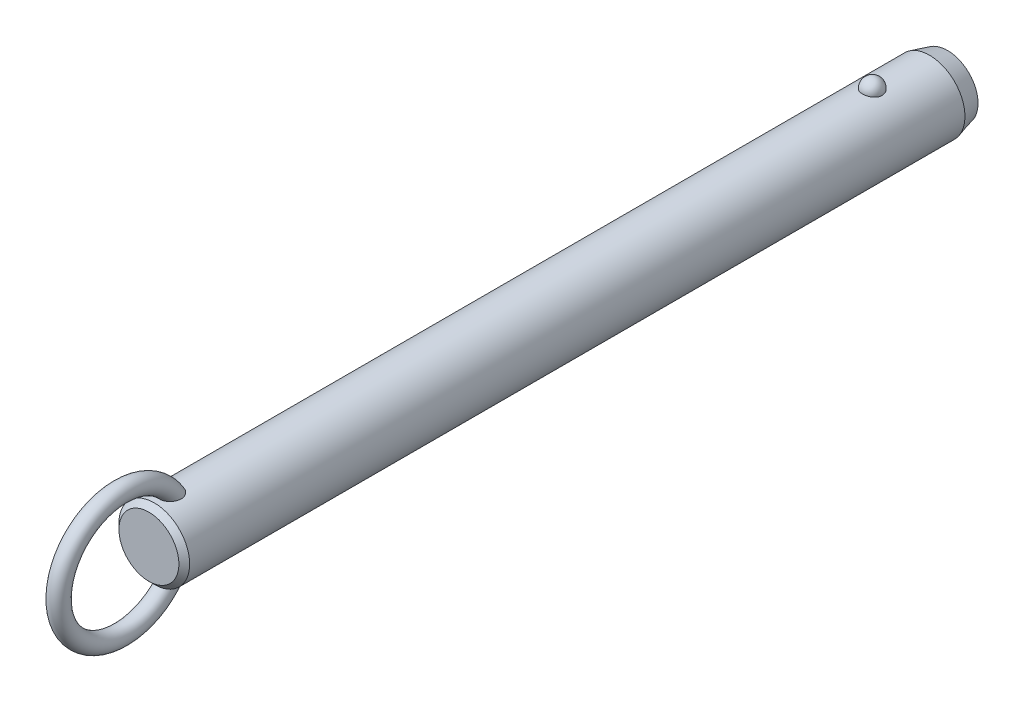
ISO-10303-21;
HEADER;
FILE_DESCRIPTION(('STEP AP214'),'2;1');
FILE_NAME('part.step','',(''),(''),'','','');
FILE_SCHEMA(('AUTOMOTIVE_DESIGN { 1 0 10303 214 1 1 1 1 }'));
ENDSEC;
DATA;
#1=APPLICATION_CONTEXT('core data for automotive mechanical design processes');
#2=APPLICATION_PROTOCOL_DEFINITION('international standard','automotive_design',2000,#1);
#3=PRODUCT_CONTEXT('',#1,'mechanical');
#4=PRODUCT('Part','Part','',(#3));
#5=PRODUCT_RELATED_PRODUCT_CATEGORY('part','',(#4));
#6=PRODUCT_DEFINITION_FORMATION('','',#4);
#7=PRODUCT_DEFINITION_CONTEXT('part definition',#1,'design');
#8=PRODUCT_DEFINITION('design','',#6,#7);
#9=PRODUCT_DEFINITION_SHAPE('','',#8);
#10=(LENGTH_UNIT() NAMED_UNIT(*) SI_UNIT(.MILLI.,.METRE.));
#11=(NAMED_UNIT(*) PLANE_ANGLE_UNIT() SI_UNIT($,.RADIAN.));
#12=(NAMED_UNIT(*) SI_UNIT($,.STERADIAN.) SOLID_ANGLE_UNIT());
#13=UNCERTAINTY_MEASURE_WITH_UNIT(LENGTH_MEASURE(1.E-05),#10,'distance_accuracy_value','');
#14=(GEOMETRIC_REPRESENTATION_CONTEXT(3) GLOBAL_UNCERTAINTY_ASSIGNED_CONTEXT((#13)) GLOBAL_UNIT_ASSIGNED_CONTEXT((#10,
#11,#12)) REPRESENTATION_CONTEXT('',''));
#15=CARTESIAN_POINT('',(0.,0.,0.));
#16=DIRECTION('',(0.,0.,1.));
#17=DIRECTION('',(1.,0.,0.));
#18=AXIS2_PLACEMENT_3D('',#15,#16,#17);
#19=CARTESIAN_POINT('',(0.,0.,149.9));
#20=DIRECTION('',(0.,0.,-1.));
#21=DIRECTION('',(-1.,0.,0.));
#22=AXIS2_PLACEMENT_3D('',#19,#20,#21);
#23=CYLINDRICAL_SURFACE('',#22,7.9);
#24=CARTESIAN_POINT('',(2.1785689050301,7.59367088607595,-2.19999999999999));
#25=CARTESIAN_POINT('',(2.17856679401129,7.59367269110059,-2.07701843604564));
#26=CARTESIAN_POINT('',(2.16853481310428,7.59657145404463,-1.95401006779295));
#27=CARTESIAN_POINT('',(2.12864689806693,7.607843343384,-1.71147811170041));
#28=CARTESIAN_POINT('',(2.09878338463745,7.61621856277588,-1.59195587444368));
#29=CARTESIAN_POINT('',(2.0199931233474,7.63749180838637,-1.3598563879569));
#30=CARTESIAN_POINT('',(1.97107475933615,7.6503878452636,-1.24727610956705));
#31=CARTESIAN_POINT('',(1.85539377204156,7.67926115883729,-1.03213234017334));
#32=CARTESIAN_POINT('',(1.78863158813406,7.69523835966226,-0.929568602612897));
#33=CARTESIAN_POINT('',(1.63856494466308,7.7285848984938,-0.736786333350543));
#34=CARTESIAN_POINT('',(1.55518140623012,7.7459606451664,-0.646630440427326));
#35=CARTESIAN_POINT('',(1.37422937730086,7.78009978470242,-0.481747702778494));
#36=CARTESIAN_POINT('',(1.27666086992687,7.79686317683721,-0.407020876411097));
#37=CARTESIAN_POINT('',(1.07024728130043,7.82786153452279,-0.275278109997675));
#38=CARTESIAN_POINT('',(0.961434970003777,7.84210353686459,-0.218212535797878));
#39=CARTESIAN_POINT('',(0.735351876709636,7.86652194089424,-0.123146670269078));
#40=CARTESIAN_POINT('',(0.618082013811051,7.87669878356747,-0.085144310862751));
#41=CARTESIAN_POINT('',(0.380637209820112,7.89170521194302,-0.0298158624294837));
#42=CARTESIAN_POINT('',(0.260550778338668,7.89662650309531,-0.0121347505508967));
#43=CARTESIAN_POINT('',(0.0190117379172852,7.90090003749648,0.00324379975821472));
#44=CARTESIAN_POINT('',(-0.102440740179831,7.90025280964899,0.00094313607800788));
#45=CARTESIAN_POINT('',(-0.341452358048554,7.89351056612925,-0.0233955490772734));
#46=CARTESIAN_POINT('',(-0.459042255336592,7.88749257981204,-0.0451545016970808));
#47=CARTESIAN_POINT('',(-0.688796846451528,7.87075812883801,-0.107408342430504));
#48=CARTESIAN_POINT('',(-0.800961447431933,7.86004158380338,-0.147903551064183));
#49=CARTESIAN_POINT('',(-1.01743634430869,7.83497131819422,-0.246799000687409));
#50=CARTESIAN_POINT('',(-1.12169791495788,7.82059709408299,-0.305300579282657));
#51=CARTESIAN_POINT('',(-1.31891765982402,7.78976470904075,-0.438549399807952));
#52=CARTESIAN_POINT('',(-1.41187469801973,7.77330633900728,-0.513298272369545));
#53=CARTESIAN_POINT('',(-1.58577142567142,7.73972434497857,-0.678622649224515));
#54=CARTESIAN_POINT('',(-1.66645140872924,7.72259402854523,-0.769470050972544));
#55=CARTESIAN_POINT('',(-1.81161503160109,7.68983776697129,-0.963538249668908));
#56=CARTESIAN_POINT('',(-1.87609753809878,7.6742119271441,-1.06675991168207));
#57=CARTESIAN_POINT('',(-1.98790138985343,7.6460202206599,-1.28401170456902));
#58=CARTESIAN_POINT('',(-2.03501994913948,7.63349104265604,-1.39815107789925));
#59=CARTESIAN_POINT('',(-2.10986724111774,7.6131449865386,-1.63301784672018));
#60=CARTESIAN_POINT('',(-2.1375965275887,7.60532797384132,-1.75374505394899));
#61=CARTESIAN_POINT('',(-2.17289256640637,7.5953195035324,-1.99782562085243));
#62=CARTESIAN_POINT('',(-2.18054294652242,7.59310471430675,-2.12116592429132));
#63=CARTESIAN_POINT('',(-2.17572919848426,7.59448538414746,-2.36741799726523));
#64=CARTESIAN_POINT('',(-2.1632656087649,7.59808068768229,-2.49032977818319));
#65=CARTESIAN_POINT('',(-2.11865035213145,7.61064035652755,-2.73161015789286));
#66=CARTESIAN_POINT('',(-2.08659579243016,7.61957823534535,-2.84999812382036));
#67=CARTESIAN_POINT('',(-2.00367799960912,7.64179982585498,-3.07955956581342));
#68=CARTESIAN_POINT('',(-1.9528140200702,7.65508371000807,-3.19073275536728));
#69=CARTESIAN_POINT('',(-1.83321113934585,7.68460381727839,-3.40337899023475));
#70=CARTESIAN_POINT('',(-1.76437735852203,7.70085556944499,-3.50479651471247));
#71=CARTESIAN_POINT('',(-1.61069526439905,7.73445734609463,-3.69446912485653));
#72=CARTESIAN_POINT('',(-1.52584634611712,7.75180741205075,-3.78272371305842));
#73=CARTESIAN_POINT('',(-1.34198059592,7.78574608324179,-3.94393987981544));
#74=CARTESIAN_POINT('',(-1.24291308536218,7.80233167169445,-4.01684434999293));
#75=CARTESIAN_POINT('',(-1.03352039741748,7.83281625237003,-4.14489386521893));
#76=CARTESIAN_POINT('',(-0.92319600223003,7.84671543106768,-4.20004014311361));
#77=CARTESIAN_POINT('',(-0.695822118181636,7.87011575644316,-4.29042017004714));
#78=CARTESIAN_POINT('',(-0.578872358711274,7.87966903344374,-4.32589112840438));
#79=CARTESIAN_POINT('',(-0.340410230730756,7.8935652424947,-4.37692226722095));
#80=CARTESIAN_POINT('',(-0.218898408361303,7.89790879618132,-4.39248482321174));
#81=CARTESIAN_POINT('',(0.0228107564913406,7.90087453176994,-4.40314405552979));
#82=CARTESIAN_POINT('',(0.142990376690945,7.89960185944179,-4.39861683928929));
#83=CARTESIAN_POINT('',(0.380829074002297,7.89171262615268,-4.37008293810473));
#84=CARTESIAN_POINT('',(0.498488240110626,7.8850962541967,-4.34607694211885));
#85=CARTESIAN_POINT('',(0.727535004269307,7.86726442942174,-4.27939317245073));
#86=CARTESIAN_POINT('',(0.838944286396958,7.85606616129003,-4.236785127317));
#87=CARTESIAN_POINT('',(1.05295421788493,7.83025654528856,-4.13408348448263));
#88=CARTESIAN_POINT('',(1.15555431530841,7.81564498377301,-4.07398879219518));
#89=CARTESIAN_POINT('',(1.35076763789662,7.7843022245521,-3.93687432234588));
#90=CARTESIAN_POINT('',(1.4432046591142,7.76754209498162,-3.85961036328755));
#91=CARTESIAN_POINT('',(1.6139111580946,7.73387857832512,-3.69076949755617));
#92=CARTESIAN_POINT('',(1.6921781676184,7.71697516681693,-3.59919010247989));
#93=CARTESIAN_POINT('',(1.83380875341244,7.6845643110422,-3.40247278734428));
#94=CARTESIAN_POINT('',(1.89689280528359,7.66908588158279,-3.29712873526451));
#95=CARTESIAN_POINT('',(2.0047823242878,7.64159441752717,-3.07707931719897));
#96=CARTESIAN_POINT('',(2.0495945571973,7.62958010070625,-2.96237743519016));
#97=CARTESIAN_POINT('',(2.11580183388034,7.61146617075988,-2.74040519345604));
#98=CARTESIAN_POINT('',(2.13929812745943,7.60484503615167,-2.63379846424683));
#99=CARTESIAN_POINT('',(2.17068242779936,7.59594664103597,-2.41813481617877));
#100=CARTESIAN_POINT('',(2.17857077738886,7.59366928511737,-2.30907795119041));
#101=CARTESIAN_POINT('',(2.1785689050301,7.59367088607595,-2.19999999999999));
#102=B_SPLINE_CURVE_WITH_KNOTS('',3,(#24,#25,#26,#27,#28,#29,#30,#31,#32,#33,#34,#35,#36,#37,
#38,#39,#40,#41,#42,#43,#44,#45,#46,#47,#48,#49,#50,#51,#52,#53,#54,#55,#56,#57,#58,#59,#60,#61,
#62,#63,#64,#65,#66,#67,#68,#69,#70,#71,#72,#73,#74,#75,#76,#77,#78,#79,#80,#81,#82,#83,#84,#85,
#86,#87,#88,#89,#90,#91,#92,#93,#94,#95,#96,#97,#98,#99,#100,#101),.UNSPECIFIED.,.T.,.F.,(4,2,2,
2,2,2,2,2,2,2,2,2,2,2,2,2,2,2,2,2,2,2,2,2,2,2,2,2,2,2,2,2,2,2,2,2,2,2,4),(0.,0.368552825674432,
0.737246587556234,1.10577831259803,1.4743009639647,1.8446206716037,2.21494081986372,
2.5842105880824,2.95344028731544,3.31611630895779,3.67875788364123,4.03628044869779,
4.39380913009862,4.75338791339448,5.11300280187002,5.47939989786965,5.8458226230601,
6.21639834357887,6.58696347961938,6.95598276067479,7.32499216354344,7.69218715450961,
8.0593967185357,8.42858578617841,8.79778880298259,9.16834203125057,9.5388695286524,
9.90482699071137,10.2707407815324,10.6298333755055,10.9889132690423,11.3466585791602,
11.7044262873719,12.0676511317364,12.4309391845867,12.8004764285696,13.1698767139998,
13.4967701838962,13.8236564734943),.UNSPECIFIED.);
#103=CARTESIAN_POINT('',(2.1785689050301,7.59367088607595,-2.19999999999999));
#104=VERTEX_POINT('',#103);
#105=EDGE_CURVE('E41',#104,#104,#102,.T.);
#106=ORIENTED_EDGE('',*,*,#105,.T.);
#107=EDGE_LOOP('',(#106));
#108=FACE_BOUND('',#107,.T.);
#109=CARTESIAN_POINT('',(0.,0.,158.22));
#110=DIRECTION('',(0.,0.,1.));
#111=DIRECTION('',(1.,0.,0.));
#112=AXIS2_PLACEMENT_3D('',#109,#110,#111);
#113=CIRCLE('',#112,7.9);
#114=CARTESIAN_POINT('',(7.9,0.,158.22));
#115=VERTEX_POINT('',#114);
#116=EDGE_CURVE('E10',#115,#115,#113,.F.);
#117=ORIENTED_EDGE('',*,*,#116,.T.);
#118=EDGE_LOOP('',(#117));
#119=FACE_BOUND('',#118,.T.);
#120=CARTESIAN_POINT('',(-0.630969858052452,-7.87476203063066,152.112432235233));
#121=CARTESIAN_POINT('',(-0.734180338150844,-7.86648998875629,152.147285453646));
#122=CARTESIAN_POINT('',(-0.834476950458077,-7.85639291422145,152.190816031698));
#123=CARTESIAN_POINT('',(-1.0262035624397,-7.83366343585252,152.294094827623));
#124=CARTESIAN_POINT('',(-1.1176141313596,-7.82102565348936,152.353877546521));
#125=CARTESIAN_POINT('',(-1.28877277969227,-7.79464922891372,152.487839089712));
#126=CARTESIAN_POINT('',(-1.36854014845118,-7.78091246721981,152.561993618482));
#127=CARTESIAN_POINT('',(-1.51461521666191,-7.75380398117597,152.722494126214));
#128=CARTESIAN_POINT('',(-1.58092966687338,-7.74043207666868,152.808833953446));
#129=CARTESIAN_POINT('',(-1.70019064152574,-7.7151252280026,152.992978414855));
#130=CARTESIAN_POINT('',(-1.75284037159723,-7.70322473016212,153.090979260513));
#131=CARTESIAN_POINT('',(-1.84263464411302,-7.68224112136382,153.294102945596));
#132=CARTESIAN_POINT('',(-1.87977299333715,-7.6731591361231,153.399228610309));
#133=CARTESIAN_POINT('',(-1.94152728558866,-7.65777930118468,153.623284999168));
#134=CARTESIAN_POINT('',(-1.96475471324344,-7.65179654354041,153.742616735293));
#135=CARTESIAN_POINT('',(-1.99449499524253,-7.64409642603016,153.98342986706));
#136=CARTESIAN_POINT('',(-2.0010005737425,-7.64238092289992,154.104912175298));
#137=CARTESIAN_POINT('',(-1.99856014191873,-7.64302120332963,154.368340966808));
#138=CARTESIAN_POINT('',(-1.98680021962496,-7.64611845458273,154.51025654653));
#139=CARTESIAN_POINT('',(-1.94457772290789,-7.65696186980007,154.791118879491));
#140=CARTESIAN_POINT('',(-1.91409393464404,-7.66471330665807,154.930062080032));
#141=CARTESIAN_POINT('',(-1.82768670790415,-7.68582947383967,155.231939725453));
#142=CARTESIAN_POINT('',(-1.76772963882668,-7.70003779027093,155.393686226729));
#143=CARTESIAN_POINT('',(-1.65998501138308,-7.72371550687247,155.627695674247));
#144=CARTESIAN_POINT('',(-1.62107967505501,-7.73200670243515,155.704297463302));
#145=CARTESIAN_POINT('',(-1.53727726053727,-7.74910377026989,155.854079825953));
#146=CARTESIAN_POINT('',(-1.49238215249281,-7.75790947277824,155.927261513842));
#147=CARTESIAN_POINT('',(-1.37397050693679,-7.77993338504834,156.10288382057));
#148=CARTESIAN_POINT('',(-1.29690364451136,-7.79328473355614,156.202955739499));
#149=CARTESIAN_POINT('',(-1.1288548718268,-7.81939266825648,156.390714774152));
#150=CARTESIAN_POINT('',(-1.0378992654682,-7.83215032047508,156.478424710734));
#151=CARTESIAN_POINT('',(-0.86953281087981,-7.85231710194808,156.613414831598));
#152=CARTESIAN_POINT('',(-0.795716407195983,-7.86021093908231,156.665076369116));
#153=CARTESIAN_POINT('',(-0.640813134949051,-7.87434920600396,156.756381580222));
#154=CARTESIAN_POINT('',(-0.559737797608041,-7.88059619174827,156.79604389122));
#155=CARTESIAN_POINT('',(-0.406456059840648,-7.88984116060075,156.854300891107));
#156=CARTESIAN_POINT('',(-0.335227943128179,-7.89321892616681,156.875384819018));
#157=CARTESIAN_POINT('',(-0.190193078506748,-7.89804235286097,156.90541418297));
#158=CARTESIAN_POINT('',(-0.11638863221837,-7.89948969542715,156.914370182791));
#159=CARTESIAN_POINT('',(0.0318414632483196,-7.90028409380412,156.919291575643));
#160=CARTESIAN_POINT('',(0.106268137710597,-7.89962640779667,156.915227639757));
#161=CARTESIAN_POINT('',(0.253290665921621,-7.8962818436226,156.894461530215));
#162=CARTESIAN_POINT('',(0.325885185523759,-7.8935935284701,156.877750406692));
#163=CARTESIAN_POINT('',(0.481441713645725,-7.88577340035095,156.828738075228));
#164=CARTESIAN_POINT('',(0.563611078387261,-7.88026321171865,156.794005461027));
#165=CARTESIAN_POINT('',(0.721129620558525,-7.86741729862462,156.711796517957));
#166=CARTESIAN_POINT('',(0.796466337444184,-7.86007832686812,156.664297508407));
#167=CARTESIAN_POINT('',(0.971456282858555,-7.84073285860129,156.536513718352));
#168=CARTESIAN_POINT('',(1.06719686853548,-7.82809461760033,156.451004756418));
#169=CARTESIAN_POINT('',(1.24418921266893,-7.80192439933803,156.266232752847));
#170=CARTESIAN_POINT('',(1.32540832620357,-7.78839049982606,156.166939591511));
#171=CARTESIAN_POINT('',(1.45199971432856,-7.76559693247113,155.989576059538));
#172=CARTESIAN_POINT('',(1.50085649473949,-7.75626094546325,155.913954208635));
#173=CARTESIAN_POINT('',(1.59197749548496,-7.7380727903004,155.758742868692));
#174=CARTESIAN_POINT('',(1.63423919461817,-7.72922080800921,155.679151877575));
#175=CARTESIAN_POINT('',(1.71222612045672,-7.71231959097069,155.516664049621));
#176=CARTESIAN_POINT('',(1.74794516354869,-7.70427111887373,155.433764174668));
#177=CARTESIAN_POINT('',(1.81270113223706,-7.68929240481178,155.265296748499));
#178=CARTESIAN_POINT('',(1.84173789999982,-7.68236218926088,155.179729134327));
#179=CARTESIAN_POINT('',(1.89322698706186,-7.6698375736,155.00528702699));
#180=CARTESIAN_POINT('',(1.91558744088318,-7.66426199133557,154.916383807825));
#181=CARTESIAN_POINT('',(1.95281367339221,-7.65485915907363,154.736969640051));
#182=CARTESIAN_POINT('',(1.96767946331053,-7.65103190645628,154.646458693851));
#183=CARTESIAN_POINT('',(2.00021456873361,-7.64262981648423,154.373732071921));
#184=CARTESIAN_POINT('',(2.00600691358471,-7.6410871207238,154.189709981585));
#185=CARTESIAN_POINT('',(1.98445334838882,-7.64669564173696,153.876501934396));
#186=CARTESIAN_POINT('',(1.96607186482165,-7.65149688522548,153.746618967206));
#187=CARTESIAN_POINT('',(1.90884967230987,-7.6659762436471,153.491632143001));
#188=CARTESIAN_POINT('',(1.87002101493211,-7.67565148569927,153.366525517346));
#189=CARTESIAN_POINT('',(1.77063986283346,-7.69918471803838,153.12454013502));
#190=CARTESIAN_POINT('',(1.70993724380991,-7.71307150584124,153.007725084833));
#191=CARTESIAN_POINT('',(1.56733070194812,-7.74330306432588,152.788144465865));
#192=CARTESIAN_POINT('',(1.48543692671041,-7.75964665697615,152.685372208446));
#193=CARTESIAN_POINT('',(1.31346177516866,-7.79047523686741,152.509380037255));
#194=CARTESIAN_POINT('',(1.22547278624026,-7.80495298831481,152.434106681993));
#195=CARTESIAN_POINT('',(1.0372435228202,-7.83218597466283,152.300486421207));
#196=CARTESIAN_POINT('',(0.937008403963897,-7.84494192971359,152.242132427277));
#197=CARTESIAN_POINT('',(0.73359933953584,-7.86649045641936,152.147027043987));
#198=CARTESIAN_POINT('',(0.630941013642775,-7.87547134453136,152.109210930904));
#199=CARTESIAN_POINT('',(0.420465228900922,-7.88950708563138,152.051116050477));
#200=CARTESIAN_POINT('',(0.312645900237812,-7.89456050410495,152.03084369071));
#201=CARTESIAN_POINT('',(0.0960869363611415,-7.9001518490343,152.008455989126));
#202=CARTESIAN_POINT('',(-0.012634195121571,-7.90073226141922,152.006169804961));
#203=CARTESIAN_POINT('',(-0.228766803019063,-7.89742350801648,152.019367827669));
#204=CARTESIAN_POINT('',(-0.336180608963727,-7.89354403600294,152.034813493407));
#205=CARTESIAN_POINT('',(-0.473410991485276,-7.88586871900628,152.066217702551));
#206=CARTESIAN_POINT('',(-0.505257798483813,-7.88388984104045,152.074354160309));
#207=CARTESIAN_POINT('',(-0.568481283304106,-7.87958326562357,152.092208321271));
#208=CARTESIAN_POINT('',(-0.599857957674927,-7.87725556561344,152.101926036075));
#209=CARTESIAN_POINT('',(-0.630969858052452,-7.87476203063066,152.112432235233));
#210=B_SPLINE_CURVE_WITH_KNOTS('',3,(#120,#121,#122,#123,#124,#125,#126,#127,#128,#129,#130,
#131,#132,#133,#134,#135,#136,#137,#138,#139,#140,#141,#142,#143,#144,#145,#146,#147,#148,#149,
#150,#151,#152,#153,#154,#155,#156,#157,#158,#159,#160,#161,#162,#163,#164,#165,#166,#167,#168,
#169,#170,#171,#172,#173,#174,#175,#176,#177,#178,#179,#180,#181,#182,#183,#184,#185,#186,#187,
#188,#189,#190,#191,#192,#193,#194,#195,#196,#197,#198,#199,#200,#201,#202,#203,#204,#205,#206,
#207,#208,#209),.UNSPECIFIED.,.T.,.F.,(4,2,2,2,2,2,2,2,2,2,2,2,2,2,2,2,2,2,2,2,2,2,2,2,2,2,2,2,
2,2,2,2,2,2,2,2,2,2,2,2,2,2,2,2,4),(0.,0.327622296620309,0.655945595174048,0.983718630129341,
1.3113267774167,1.64554655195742,1.97989964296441,2.34365728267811,2.70757317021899,
3.13333684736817,3.55958380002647,4.07655306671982,4.33527897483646,4.59391999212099,
4.97382437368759,5.353017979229,5.62348245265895,5.89352465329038,6.11565959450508,
6.33760092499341,6.56004255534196,6.78264174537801,7.0493084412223,7.31645206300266,
7.70130871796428,8.08701995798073,8.35824509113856,8.62957365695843,8.9011573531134,
9.1727474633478,9.44791855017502,9.72308922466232,10.2715298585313,10.6638393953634,
11.0559179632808,11.4507403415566,11.8453740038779,12.1936425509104,12.5417649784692,
12.8695063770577,13.1973674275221,13.5221104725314,13.8461490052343,13.9449071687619,
14.0436660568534),.UNSPECIFIED.);
#211=CARTESIAN_POINT('',(-0.630969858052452,-7.87476203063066,152.112432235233));
#212=VERTEX_POINT('',#211);
#213=EDGE_CURVE('E59',#212,#212,#210,.T.);
#214=ORIENTED_EDGE('',*,*,#213,.T.);
#215=EDGE_LOOP('',(#214));
#216=FACE_BOUND('',#215,.T.);
#217=CARTESIAN_POINT('',(-0.630969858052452,7.87476203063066,152.112432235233));
#218=CARTESIAN_POINT('',(-0.528918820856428,7.88293636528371,152.077979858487));
#219=CARTESIAN_POINT('',(-0.423745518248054,7.88934810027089,152.051915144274));
#220=CARTESIAN_POINT('',(-0.210236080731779,7.8979273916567,152.017282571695));
#221=CARTESIAN_POINT('',(-0.101893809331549,7.90008607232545,152.008751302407));
#222=CARTESIAN_POINT('',(0.11466056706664,7.89990877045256,152.009457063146));
#223=CARTESIAN_POINT('',(0.222872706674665,7.89757640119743,152.01867980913));
#224=CARTESIAN_POINT('',(0.436107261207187,7.88867538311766,152.054652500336));
#225=CARTESIAN_POINT('',(0.541131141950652,7.8821087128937,152.08139425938));
#226=CARTESIAN_POINT('',(0.745085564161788,7.86545130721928,152.151756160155));
#227=CARTESIAN_POINT('',(0.844015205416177,7.85536005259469,152.195378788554));
#228=CARTESIAN_POINT('',(1.03299167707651,7.83275153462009,152.298379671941));
#229=CARTESIAN_POINT('',(1.12303841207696,7.8202342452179,152.357758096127));
#230=CARTESIAN_POINT('',(1.29214734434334,7.79408219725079,152.490864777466));
#231=CARTESIAN_POINT('',(1.37116907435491,7.78044359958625,152.564643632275));
#232=CARTESIAN_POINT('',(1.51597677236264,7.75353170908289,152.724235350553));
#233=CARTESIAN_POINT('',(1.58176261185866,7.74025841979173,152.810048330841));
#234=CARTESIAN_POINT('',(1.70057386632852,7.71504069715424,152.993644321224));
#235=CARTESIAN_POINT('',(1.75320073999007,7.7031425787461,153.091690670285));
#236=CARTESIAN_POINT('',(1.8429376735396,7.68216822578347,153.294893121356));
#237=CARTESIAN_POINT('',(1.88004278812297,7.67309289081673,153.400051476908));
#238=CARTESIAN_POINT('',(1.9417232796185,7.6577294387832,153.624167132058));
#239=CARTESIAN_POINT('',(1.96491037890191,7.65175648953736,153.743524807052));
#240=CARTESIAN_POINT('',(1.9945689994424,7.64407702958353,153.984384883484));
#241=CARTESIAN_POINT('',(2.00103304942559,7.64237242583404,154.10588821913));
#242=CARTESIAN_POINT('',(1.99850166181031,7.64303650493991,154.369368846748));
#243=CARTESIAN_POINT('',(1.98669038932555,7.64614714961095,154.511314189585));
#244=CARTESIAN_POINT('',(1.94436120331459,7.6570170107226,154.792228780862));
#245=CARTESIAN_POINT('',(1.91382203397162,7.66478150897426,154.931194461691));
#246=CARTESIAN_POINT('',(1.82728754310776,7.68592483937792,155.233111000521));
#247=CARTESIAN_POINT('',(1.76725778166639,7.7001468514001,155.394872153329));
#248=CARTESIAN_POINT('',(1.65939700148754,7.72384204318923,155.628891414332));
#249=CARTESIAN_POINT('',(1.62045187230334,7.73213852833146,155.705494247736));
#250=CARTESIAN_POINT('',(1.53656684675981,7.74924489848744,155.855273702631));
#251=CARTESIAN_POINT('',(1.49162892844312,7.75805461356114,155.928451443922));
#252=CARTESIAN_POINT('',(1.37317698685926,7.78007342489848,156.103952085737));
#253=CARTESIAN_POINT('',(1.29612360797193,7.79341423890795,156.203911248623));
#254=CARTESIAN_POINT('',(1.12812043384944,7.81949839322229,156.39145083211));
#255=CARTESIAN_POINT('',(1.03719688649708,7.83224280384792,156.479054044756));
#256=CARTESIAN_POINT('',(0.868871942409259,7.85239026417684,156.61389715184));
#257=CARTESIAN_POINT('',(0.795056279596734,7.86027769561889,156.665511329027));
#258=CARTESIAN_POINT('',(0.640160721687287,7.87440222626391,156.756720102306));
#259=CARTESIAN_POINT('',(0.559092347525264,7.88064188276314,156.796333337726));
#260=CARTESIAN_POINT('',(0.405820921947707,7.8898738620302,156.854505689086));
#261=CARTESIAN_POINT('',(0.334594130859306,7.89324577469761,156.875552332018));
#262=CARTESIAN_POINT('',(0.189568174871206,7.89805733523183,156.905507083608));
#263=CARTESIAN_POINT('',(0.115771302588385,7.89949866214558,156.914425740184));
#264=CARTESIAN_POINT('',(-0.0324359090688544,7.90028156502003,156.91927589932));
#265=CARTESIAN_POINT('',(-0.106847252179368,7.89961843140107,156.915178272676));
#266=CARTESIAN_POINT('',(-0.253834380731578,7.8962642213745,156.894351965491));
#267=CARTESIAN_POINT('',(-0.326408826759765,7.89357170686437,156.877614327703));
#268=CARTESIAN_POINT('',(-0.481962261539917,7.88574179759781,156.828539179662));
#269=CARTESIAN_POINT('',(-0.564145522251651,7.88022507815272,156.793763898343));
#270=CARTESIAN_POINT('',(-0.7216852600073,7.86736646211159,156.711468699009));
#271=CARTESIAN_POINT('',(-0.797029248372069,7.8600213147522,156.663926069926));
#272=CARTESIAN_POINT('',(-0.972044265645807,7.84066026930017,156.536026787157));
#273=CARTESIAN_POINT('',(-1.06779803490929,7.828012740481,156.450443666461));
#274=CARTESIAN_POINT('',(-1.24480531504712,7.80182621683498,156.265522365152));
#275=CARTESIAN_POINT('',(-1.32602618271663,7.78828530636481,156.166154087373));
#276=CARTESIAN_POINT('',(-1.45259834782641,7.76548487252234,155.988680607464));
#277=CARTESIAN_POINT('',(-1.5014385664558,7.75614818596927,155.913025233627));
#278=CARTESIAN_POINT('',(-1.59252410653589,7.73796020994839,155.757748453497));
#279=CARTESIAN_POINT('',(-1.63476690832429,7.729109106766,155.678125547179));
#280=CARTESIAN_POINT('',(-1.7127131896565,7.71221133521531,155.515575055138));
#281=CARTESIAN_POINT('',(-1.74841047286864,7.70416543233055,155.432644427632));
#282=CARTESIAN_POINT('',(-1.81311929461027,7.6891937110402,155.264116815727));
#283=CARTESIAN_POINT('',(-1.84213067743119,7.68226791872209,155.178519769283));
#284=CARTESIAN_POINT('',(-1.89356259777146,7.66975461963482,155.004025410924));
#285=CARTESIAN_POINT('',(-1.91589165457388,7.66418586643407,154.915099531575));
#286=CARTESIAN_POINT('',(-1.9530507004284,7.65479859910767,154.735642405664));
#287=CARTESIAN_POINT('',(-1.96788069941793,7.65098008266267,154.645111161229));
#288=CARTESIAN_POINT('',(-2.00030078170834,7.64260704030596,154.372327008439));
#289=CARTESIAN_POINT('',(-2.00600576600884,7.64108760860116,154.188271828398));
#290=CARTESIAN_POINT('',(-1.9842848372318,7.64673945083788,153.875080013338));
#291=CARTESIAN_POINT('',(-1.96583698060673,7.65155751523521,153.745240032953));
#292=CARTESIAN_POINT('',(-1.90848948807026,7.66606613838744,153.490361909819));
#293=CARTESIAN_POINT('',(-1.86960376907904,7.67575338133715,153.365320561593));
#294=CARTESIAN_POINT('',(-1.77013421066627,7.6993013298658,153.123500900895));
#295=CARTESIAN_POINT('',(-1.70940488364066,7.71318991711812,153.006784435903));
#296=CARTESIAN_POINT('',(-1.5667295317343,7.74342495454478,152.787340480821));
#297=CARTESIAN_POINT('',(-1.48478316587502,7.75977144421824,152.68461321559));
#298=CARTESIAN_POINT('',(-1.31266325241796,7.79061163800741,152.508643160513));
#299=CARTESIAN_POINT('',(-1.22456383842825,7.80509908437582,152.433358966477));
#300=CARTESIAN_POINT('',(-1.03622400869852,7.83231881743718,152.299865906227));
#301=CARTESIAN_POINT('',(-0.93601531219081,7.84505551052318,152.241613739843));
#302=CARTESIAN_POINT('',(-0.798824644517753,7.85957802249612,152.177540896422));
#303=CARTESIAN_POINT('',(-0.765787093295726,7.86286821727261,152.163224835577));
#304=CARTESIAN_POINT('',(-0.698939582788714,7.86909211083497,152.136436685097));
#305=CARTESIAN_POINT('',(-0.665129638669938,7.8720258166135,152.123964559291));
#306=CARTESIAN_POINT('',(-0.630969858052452,7.87476203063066,152.112432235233));
#307=B_SPLINE_CURVE_WITH_KNOTS('',3,(#217,#218,#219,#220,#221,#222,#223,#224,#225,#226,#227,
#228,#229,#230,#231,#232,#233,#234,#235,#236,#237,#238,#239,#240,#241,#242,#243,#244,#245,#246,
#247,#248,#249,#250,#251,#252,#253,#254,#255,#256,#257,#258,#259,#260,#261,#262,#263,#264,#265,
#266,#267,#268,#269,#270,#271,#272,#273,#274,#275,#276,#277,#278,#279,#280,#281,#282,#283,#284,
#285,#286,#287,#288,#289,#290,#291,#292,#293,#294,#295,#296,#297,#298,#299,#300,#301,#302,#303,
#304,#305,#306),.UNSPECIFIED.,.T.,.F.,(4,2,2,2,2,2,2,2,2,2,2,2,2,2,2,2,2,2,2,2,2,2,2,2,2,2,2,2,
2,2,2,2,2,2,2,2,2,2,2,2,2,2,2,2,4),(0.,0.323920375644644,0.648516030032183,0.972850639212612,
1.29703380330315,1.62126473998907,1.94549915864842,2.27089401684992,2.59629203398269,
2.93059633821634,3.26500707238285,3.6288164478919,3.99278833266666,4.41865421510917,
4.84500434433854,5.36209210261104,5.62087589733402,5.87957448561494,6.25918598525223,
6.63808782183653,6.90846748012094,7.17842501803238,7.40052350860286,7.62242871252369,
7.84483086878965,8.0673907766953,8.33414615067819,8.60137921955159,8.98641454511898,
9.37230415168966,9.64358673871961,9.91497268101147,10.1866142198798,10.4582620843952,
10.7334745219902,11.008686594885,11.5572126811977,11.9494246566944,12.3413699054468,
12.7359755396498,13.1305875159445,13.4791770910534,13.82687259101,13.9353013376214,
14.0437279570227),.UNSPECIFIED.);
#308=CARTESIAN_POINT('',(-0.630969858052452,7.87476203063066,152.112432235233));
#309=VERTEX_POINT('',#308);
#310=EDGE_CURVE('E67',#309,#309,#307,.T.);
#311=ORIENTED_EDGE('',*,*,#310,.T.);
#312=EDGE_LOOP('',(#311));
#313=FACE_BOUND('',#312,.T.);
#314=CARTESIAN_POINT('',(0.,0.,-14.9999999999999));
#315=DIRECTION('',(0.,0.,-1.));
#316=DIRECTION('',(-1.,0.,0.));
#317=AXIS2_PLACEMENT_3D('',#314,#315,#316);
#318=CIRCLE('',#317,7.9);
#319=CARTESIAN_POINT('',(-7.9,0.,-14.9999999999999));
#320=VERTEX_POINT('',#319);
#321=EDGE_CURVE('E56',#320,#320,#318,.F.);
#322=ORIENTED_EDGE('',*,*,#321,.T.);
#323=EDGE_LOOP('',(#322));
#324=FACE_BOUND('',#323,.T.);
#325=ADVANCED_FACE('F37',(#108,#119,#216,#313,#324),#23,.T.);
#326=CARTESIAN_POINT('',(0.,0.,-19.));
#327=DIRECTION('',(0.,0.,-1.));
#328=DIRECTION('',(-1.,0.,0.));
#329=AXIS2_PLACEMENT_3D('',#326,#327,#328);
#330=PLANE('',#329);
#331=CARTESIAN_POINT('',(0.,0.,-19.));
#332=DIRECTION('',(0.,0.,-1.));
#333=DIRECTION('',(-1.,0.,0.));
#334=AXIS2_PLACEMENT_3D('',#331,#332,#333);
#335=CIRCLE('',#334,6.82820323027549);
#336=CARTESIAN_POINT('',(-6.82820323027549,0.,-19.));
#337=VERTEX_POINT('',#336);
#338=EDGE_CURVE('E66',#337,#337,#335,.T.);
#339=ORIENTED_EDGE('',*,*,#338,.T.);
#340=EDGE_LOOP('',(#339));
#341=FACE_BOUND('',#340,.T.);
#342=ADVANCED_FACE('F85',(#341),#330,.T.);
#343=CARTESIAN_POINT('',(0.,0.,-19.));
#344=DIRECTION('',(0.,0.,1.));
#345=DIRECTION('',(1.,0.,0.));
#346=AXIS2_PLACEMENT_3D('',#343,#344,#345);
#347=CONICAL_SURFACE('',#346,6.82820323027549,0.261799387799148);
#348=ORIENTED_EDGE('',*,*,#321,.F.);
#349=EDGE_LOOP('',(#348));
#350=FACE_BOUND('',#349,.T.);
#351=ORIENTED_EDGE('',*,*,#338,.F.);
#352=EDGE_LOOP('',(#351));
#353=FACE_BOUND('',#352,.T.);
#354=ADVANCED_FACE('F83',(#350,#353),#347,.T.);
#355=CARTESIAN_POINT('',(0.,0.,159.42));
#356=DIRECTION('',(0.,0.,1.));
#357=DIRECTION('',(1.,0.,0.));
#358=AXIS2_PLACEMENT_3D('',#355,#356,#357);
#359=PLANE('',#358);
#360=CARTESIAN_POINT('',(0.,0.,159.42));
#361=DIRECTION('',(0.,0.,1.));
#362=DIRECTION('',(1.,0.,0.));
#363=AXIS2_PLACEMENT_3D('',#360,#361,#362);
#364=CIRCLE('',#363,6.70000000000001);
#365=CARTESIAN_POINT('',(6.70000000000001,0.,159.42));
#366=VERTEX_POINT('',#365);
#367=EDGE_CURVE('E50',#366,#366,#364,.T.);
#368=ORIENTED_EDGE('',*,*,#367,.T.);
#369=EDGE_LOOP('',(#368));
#370=FACE_BOUND('',#369,.T.);
#371=ADVANCED_FACE('F77',(#370),#359,.T.);
#372=CARTESIAN_POINT('',(0.,0.,165.75));
#373=DIRECTION('',(1.,0.,0.));
#374=DIRECTION('',(0.,0.,-1.));
#375=AXIS2_PLACEMENT_3D('',#372,#373,#374);
#376=TOROIDAL_SURFACE('',#375,13.85,2.);
#377=ORIENTED_EDGE('',*,*,#310,.F.);
#378=EDGE_LOOP('',(#377));
#379=FACE_BOUND('',#378,.T.);
#380=ORIENTED_EDGE('',*,*,#213,.F.);
#381=EDGE_LOOP('',(#380));
#382=FACE_BOUND('',#381,.T.);
#383=ADVANCED_FACE('F73',(#379,#382),#376,.T.);
#384=CARTESIAN_POINT('',(0.,0.,159.42));
#385=DIRECTION('',(0.,0.,-1.));
#386=DIRECTION('',(-1.,0.,0.));
#387=AXIS2_PLACEMENT_3D('',#384,#385,#386);
#388=CONICAL_SURFACE('',#387,6.70000000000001,0.785398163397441);
#389=ORIENTED_EDGE('',*,*,#116,.F.);
#390=EDGE_LOOP('',(#389));
#391=FACE_BOUND('',#390,.T.);
#392=ORIENTED_EDGE('',*,*,#367,.F.);
#393=EDGE_LOOP('',(#392));
#394=FACE_BOUND('',#393,.T.);
#395=ADVANCED_FACE('F39',(#391,#394),#388,.T.);
#396=CARTESIAN_POINT('',(0.,7.9,-2.19999999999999));
#397=DIRECTION('',(0.,1.,0.));
#398=DIRECTION('',(0.,0.,-1.));
#399=AXIS2_PLACEMENT_3D('',#396,#397,#398);
#400=SPHERICAL_SURFACE('',#399,2.2);
#401=ORIENTED_EDGE('',*,*,#105,.F.);
#402=EDGE_LOOP('',(#401));
#403=FACE_BOUND('',#402,.T.);
#404=ADVANCED_FACE('F79',(#403),#400,.T.);
#405=CLOSED_SHELL('',(#325,#342,#354,#371,#383,#395,#404));
#406=MANIFOLD_SOLID_BREP('B2',#405);
#407=ADVANCED_BREP_SHAPE_REPRESENTATION('',(#18,#406),#14);
#408=SHAPE_DEFINITION_REPRESENTATION(#9,#407);
ENDSEC;
END-ISO-10303-21;
